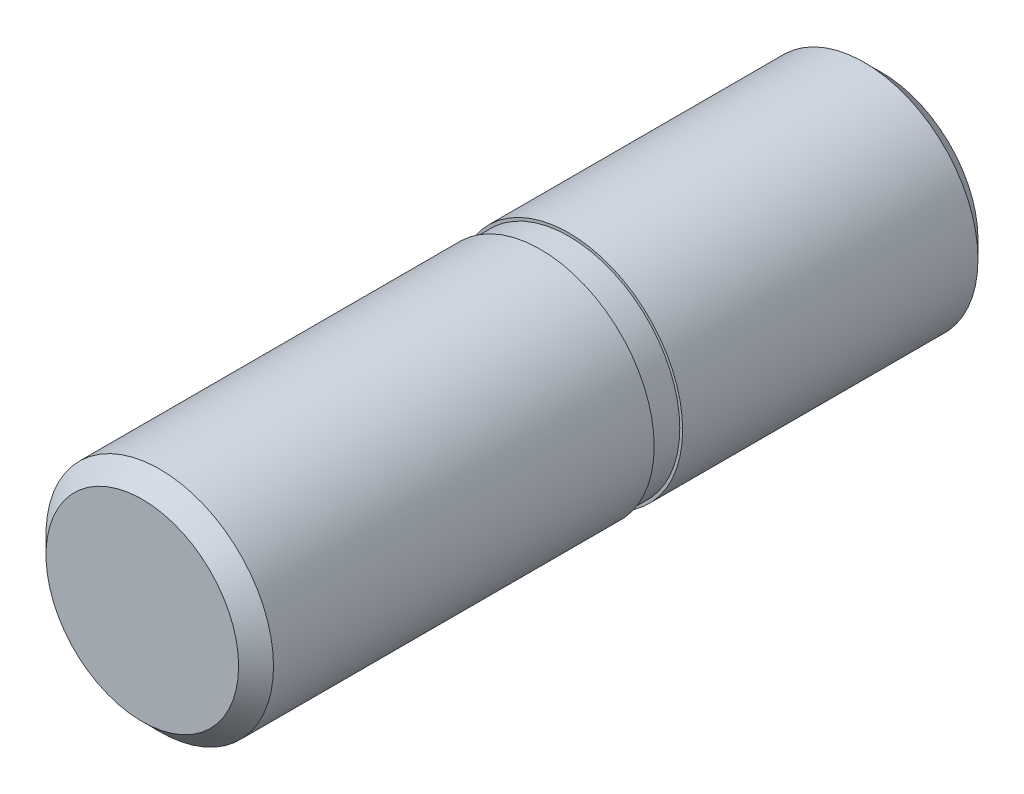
ISO-10303-21;
HEADER;
FILE_DESCRIPTION(('STEP AP214'),'2;1');
FILE_NAME('part.step','',(''),(''),'','','');
FILE_SCHEMA(('AUTOMOTIVE_DESIGN { 1 0 10303 214 1 1 1 1 }'));
ENDSEC;
DATA;
#1=APPLICATION_CONTEXT('core data for automotive mechanical design processes');
#2=APPLICATION_PROTOCOL_DEFINITION('international standard','automotive_design',2000,#1);
#3=PRODUCT_CONTEXT('',#1,'mechanical');
#4=PRODUCT('Part','Part','',(#3));
#5=PRODUCT_RELATED_PRODUCT_CATEGORY('part','',(#4));
#6=PRODUCT_DEFINITION_FORMATION('','',#4);
#7=PRODUCT_DEFINITION_CONTEXT('part definition',#1,'design');
#8=PRODUCT_DEFINITION('design','',#6,#7);
#9=PRODUCT_DEFINITION_SHAPE('','',#8);
#10=(LENGTH_UNIT() NAMED_UNIT(*) SI_UNIT(.MILLI.,.METRE.));
#11=(NAMED_UNIT(*) PLANE_ANGLE_UNIT() SI_UNIT($,.RADIAN.));
#12=(NAMED_UNIT(*) SI_UNIT($,.STERADIAN.) SOLID_ANGLE_UNIT());
#13=UNCERTAINTY_MEASURE_WITH_UNIT(LENGTH_MEASURE(1.E-05),#10,'distance_accuracy_value','');
#14=(GEOMETRIC_REPRESENTATION_CONTEXT(3) GLOBAL_UNCERTAINTY_ASSIGNED_CONTEXT((#13)) GLOBAL_UNIT_ASSIGNED_CONTEXT((#10,
#11,#12)) REPRESENTATION_CONTEXT('',''));
#15=CARTESIAN_POINT('',(0.,0.,0.));
#16=DIRECTION('',(0.,0.,1.));
#17=DIRECTION('',(1.,0.,0.));
#18=AXIS2_PLACEMENT_3D('',#15,#16,#17);
#19=CARTESIAN_POINT('',(0.,0.,5.));
#20=DIRECTION('',(0.,0.,1.));
#21=DIRECTION('',(1.,0.,0.));
#22=AXIS2_PLACEMENT_3D('',#19,#20,#21);
#23=CYLINDRICAL_SURFACE('',#22,8.);
#24=CARTESIAN_POINT('',(0.,0.,28.773));
#25=DIRECTION('',(0.,0.,1.));
#26=DIRECTION('',(1.,0.,0.));
#27=AXIS2_PLACEMENT_3D('',#24,#25,#26);
#28=CIRCLE('',#27,8.);
#29=CARTESIAN_POINT('',(8.,0.,28.773));
#30=VERTEX_POINT('',#29);
#31=EDGE_CURVE('E18',#30,#30,#28,.F.);
#32=ORIENTED_EDGE('',*,*,#31,.T.);
#33=EDGE_LOOP('',(#32));
#34=FACE_BOUND('',#33,.T.);
#35=CARTESIAN_POINT('',(0.,0.,2.));
#36=DIRECTION('',(0.,0.,1.));
#37=DIRECTION('',(1.,0.,0.));
#38=AXIS2_PLACEMENT_3D('',#35,#36,#37);
#39=CIRCLE('',#38,8.);
#40=CARTESIAN_POINT('',(8.,0.,2.));
#41=VERTEX_POINT('',#40);
#42=EDGE_CURVE('E26',#41,#41,#39,.T.);
#43=ORIENTED_EDGE('',*,*,#42,.T.);
#44=EDGE_LOOP('',(#43));
#45=FACE_BOUND('',#44,.T.);
#46=ADVANCED_FACE('F12',(#34,#45),#23,.T.);
#47=CARTESIAN_POINT('',(0.,0.,2.));
#48=DIRECTION('',(0.,0.,1.));
#49=DIRECTION('',(1.,0.,0.));
#50=AXIS2_PLACEMENT_3D('',#47,#48,#49);
#51=PLANE('',#50);
#52=CARTESIAN_POINT('',(0.,0.,2.));
#53=DIRECTION('',(0.,0.,-1.));
#54=DIRECTION('',(-1.,0.,0.));
#55=AXIS2_PLACEMENT_3D('',#52,#53,#54);
#56=CIRCLE('',#55,7.8);
#57=CARTESIAN_POINT('',(-7.8,0.,2.));
#58=VERTEX_POINT('',#57);
#59=EDGE_CURVE('E33',#58,#58,#56,.T.);
#60=ORIENTED_EDGE('',*,*,#59,.F.);
#61=EDGE_LOOP('',(#60));
#62=FACE_BOUND('',#61,.T.);
#63=ORIENTED_EDGE('',*,*,#42,.F.);
#64=EDGE_LOOP('',(#63));
#65=FACE_BOUND('',#64,.T.);
#66=ADVANCED_FACE('F46',(#62,#65),#51,.F.);
#67=CARTESIAN_POINT('',(0.,0.,30.));
#68=DIRECTION('',(0.,0.,1.));
#69=DIRECTION('',(1.,0.,0.));
#70=AXIS2_PLACEMENT_3D('',#67,#68,#69);
#71=PLANE('',#70);
#72=CARTESIAN_POINT('',(0.,0.,30.));
#73=DIRECTION('',(0.,0.,1.));
#74=DIRECTION('',(1.,0.,0.));
#75=AXIS2_PLACEMENT_3D('',#72,#73,#74);
#76=CIRCLE('',#75,6.773);
#77=CARTESIAN_POINT('',(6.773,0.,30.));
#78=VERTEX_POINT('',#77);
#79=EDGE_CURVE('E22',#78,#78,#76,.T.);
#80=ORIENTED_EDGE('',*,*,#79,.T.);
#81=EDGE_LOOP('',(#80));
#82=FACE_BOUND('',#81,.T.);
#83=ADVANCED_FACE('F49',(#82),#71,.T.);
#84=CARTESIAN_POINT('',(0.,0.,30.));
#85=DIRECTION('',(0.,0.,-1.));
#86=DIRECTION('',(-1.,0.,0.));
#87=AXIS2_PLACEMENT_3D('',#84,#85,#86);
#88=CONICAL_SURFACE('',#87,6.773,0.785398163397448);
#89=ORIENTED_EDGE('',*,*,#31,.F.);
#90=EDGE_LOOP('',(#89));
#91=FACE_BOUND('',#90,.T.);
#92=ORIENTED_EDGE('',*,*,#79,.F.);
#93=EDGE_LOOP('',(#92));
#94=FACE_BOUND('',#93,.T.);
#95=ADVANCED_FACE('F72',(#91,#94),#88,.T.);
#96=CARTESIAN_POINT('',(0.,0.,-4.99794967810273));
#97=DIRECTION('',(0.,0.,-1.));
#98=DIRECTION('',(-1.,0.,0.));
#99=AXIS2_PLACEMENT_3D('',#96,#97,#98);
#100=CYLINDRICAL_SURFACE('',#99,7.8);
#101=ORIENTED_EDGE('',*,*,#59,.T.);
#102=EDGE_LOOP('',(#101));
#103=FACE_BOUND('',#102,.T.);
#104=CARTESIAN_POINT('',(0.,0.,0.));
#105=DIRECTION('',(0.,0.,1.));
#106=DIRECTION('',(1.,0.,0.));
#107=AXIS2_PLACEMENT_3D('',#104,#105,#106);
#108=CIRCLE('',#107,7.8);
#109=CARTESIAN_POINT('',(7.8,0.,0.));
#110=VERTEX_POINT('',#109);
#111=EDGE_CURVE('E8',#110,#110,#108,.T.);
#112=ORIENTED_EDGE('',*,*,#111,.T.);
#113=EDGE_LOOP('',(#112));
#114=FACE_BOUND('',#113,.T.);
#115=ADVANCED_FACE('F44',(#103,#114),#100,.T.);
#116=CARTESIAN_POINT('',(0.,3.3865,-22.));
#117=DIRECTION('',(0.,0.,-1.));
#118=DIRECTION('',(-1.,0.,0.));
#119=AXIS2_PLACEMENT_3D('',#116,#117,#118);
#120=PLANE('',#119);
#121=CARTESIAN_POINT('',(0.,0.,-22.));
#122=DIRECTION('',(0.,0.,1.));
#123=DIRECTION('',(1.,0.,0.));
#124=AXIS2_PLACEMENT_3D('',#121,#122,#123);
#125=CIRCLE('',#124,6.773);
#126=CARTESIAN_POINT('',(6.773,0.,-22.));
#127=VERTEX_POINT('',#126);
#128=EDGE_CURVE('E29',#127,#127,#125,.T.);
#129=ORIENTED_EDGE('',*,*,#128,.F.);
#130=EDGE_LOOP('',(#129));
#131=FACE_BOUND('',#130,.T.);
#132=ADVANCED_FACE('F89',(#131),#120,.T.);
#133=CARTESIAN_POINT('',(0.,0.,-20.773));
#134=DIRECTION('',(0.,0.,1.));
#135=DIRECTION('',(1.,0.,0.));
#136=AXIS2_PLACEMENT_3D('',#133,#134,#135);
#137=CONICAL_SURFACE('',#136,8.,0.785398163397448);
#138=CARTESIAN_POINT('',(0.,0.,-20.773));
#139=DIRECTION('',(0.,0.,1.));
#140=DIRECTION('',(1.,0.,0.));
#141=AXIS2_PLACEMENT_3D('',#138,#139,#140);
#142=CIRCLE('',#141,8.);
#143=CARTESIAN_POINT('',(8.,0.,-20.773));
#144=VERTEX_POINT('',#143);
#145=EDGE_CURVE('E32',#144,#144,#142,.T.);
#146=ORIENTED_EDGE('',*,*,#145,.F.);
#147=EDGE_LOOP('',(#146));
#148=FACE_BOUND('',#147,.T.);
#149=ORIENTED_EDGE('',*,*,#128,.T.);
#150=EDGE_LOOP('',(#149));
#151=FACE_BOUND('',#150,.T.);
#152=ADVANCED_FACE('F97',(#148,#151),#137,.T.);
#153=CARTESIAN_POINT('',(0.,0.,5.));
#154=DIRECTION('',(0.,0.,1.));
#155=DIRECTION('',(1.,0.,0.));
#156=AXIS2_PLACEMENT_3D('',#153,#154,#155);
#157=CYLINDRICAL_SURFACE('',#156,8.);
#158=CARTESIAN_POINT('',(0.,0.,0.));
#159=DIRECTION('',(0.,0.,1.));
#160=DIRECTION('',(1.,0.,0.));
#161=AXIS2_PLACEMENT_3D('',#158,#159,#160);
#162=CIRCLE('',#161,8.);
#163=CARTESIAN_POINT('',(8.,0.,0.));
#164=VERTEX_POINT('',#163);
#165=EDGE_CURVE('E34',#164,#164,#162,.T.);
#166=ORIENTED_EDGE('',*,*,#165,.F.);
#167=EDGE_LOOP('',(#166));
#168=FACE_BOUND('',#167,.T.);
#169=ORIENTED_EDGE('',*,*,#145,.T.);
#170=EDGE_LOOP('',(#169));
#171=FACE_BOUND('',#170,.T.);
#172=ADVANCED_FACE('F106',(#168,#171),#157,.T.);
#173=CARTESIAN_POINT('',(0.,0.,0.));
#174=DIRECTION('',(0.,0.,1.));
#175=DIRECTION('',(1.,0.,0.));
#176=AXIS2_PLACEMENT_3D('',#173,#174,#175);
#177=PLANE('',#176);
#178=ORIENTED_EDGE('',*,*,#111,.F.);
#179=EDGE_LOOP('',(#178));
#180=FACE_BOUND('',#179,.T.);
#181=ORIENTED_EDGE('',*,*,#165,.T.);
#182=EDGE_LOOP('',(#181));
#183=FACE_BOUND('',#182,.T.);
#184=ADVANCED_FACE('F115',(#180,#183),#177,.T.);
#185=CLOSED_SHELL('',(#46,#66,#83,#95,#115,#132,#152,#172,#184));
#186=MANIFOLD_SOLID_BREP('B1',#185);
#187=ADVANCED_BREP_SHAPE_REPRESENTATION('',(#18,#186),#14);
#188=SHAPE_DEFINITION_REPRESENTATION(#9,#187);
ENDSEC;
END-ISO-10303-21;
